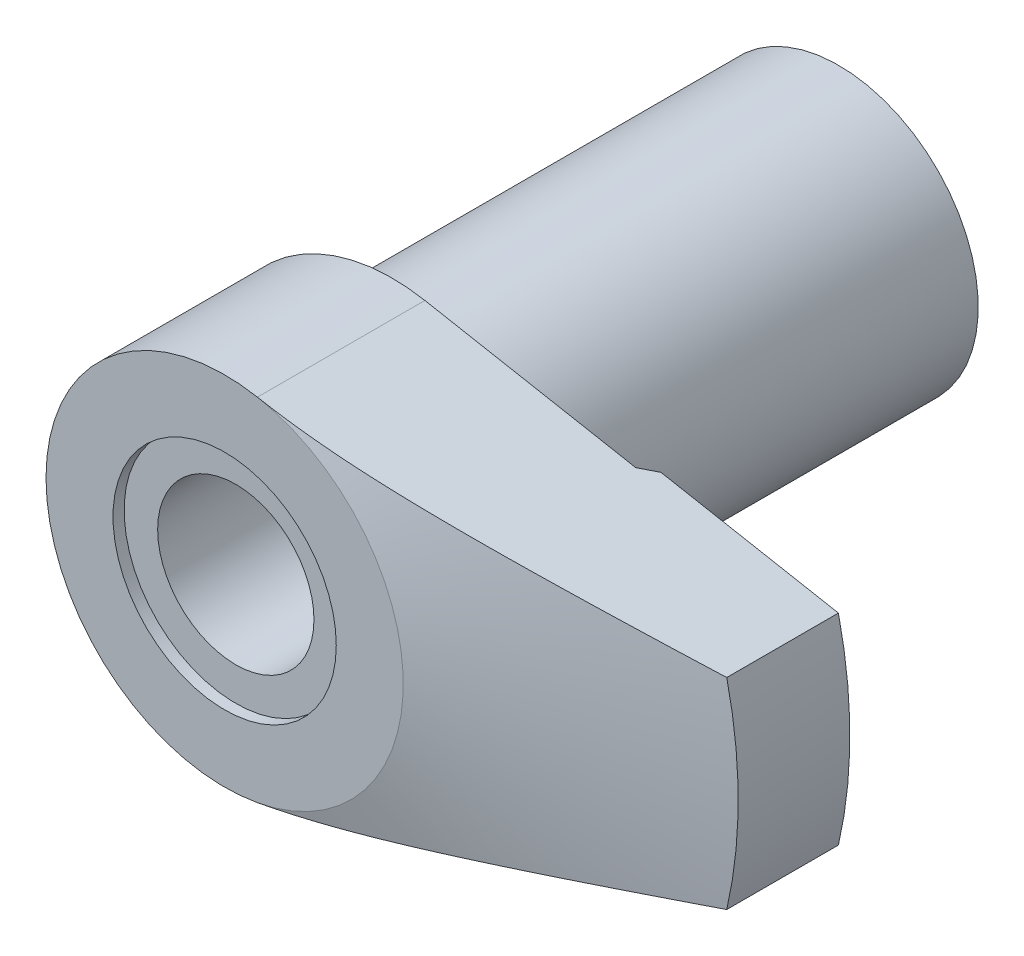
ISO-10303-21;
HEADER;
FILE_DESCRIPTION(('STEP AP214'),'2;1');
FILE_NAME('part.step','',(''),(''),'','','');
FILE_SCHEMA(('AUTOMOTIVE_DESIGN { 1 0 10303 214 1 1 1 1 }'));
ENDSEC;
DATA;
#1=APPLICATION_CONTEXT('core data for automotive mechanical design processes');
#2=APPLICATION_PROTOCOL_DEFINITION('international standard','automotive_design',2000,#1);
#3=PRODUCT_CONTEXT('',#1,'mechanical');
#4=PRODUCT('Part','Part','',(#3));
#5=PRODUCT_RELATED_PRODUCT_CATEGORY('part','',(#4));
#6=PRODUCT_DEFINITION_FORMATION('','',#4);
#7=PRODUCT_DEFINITION_CONTEXT('part definition',#1,'design');
#8=PRODUCT_DEFINITION('design','',#6,#7);
#9=PRODUCT_DEFINITION_SHAPE('','',#8);
#10=(LENGTH_UNIT() NAMED_UNIT(*) SI_UNIT(.MILLI.,.METRE.));
#11=(NAMED_UNIT(*) PLANE_ANGLE_UNIT() SI_UNIT($,.RADIAN.));
#12=(NAMED_UNIT(*) SI_UNIT($,.STERADIAN.) SOLID_ANGLE_UNIT());
#13=UNCERTAINTY_MEASURE_WITH_UNIT(LENGTH_MEASURE(1.E-05),#10,'distance_accuracy_value','');
#14=(GEOMETRIC_REPRESENTATION_CONTEXT(3) GLOBAL_UNCERTAINTY_ASSIGNED_CONTEXT((#13)) GLOBAL_UNIT_ASSIGNED_CONTEXT((#10,
#11,#12)) REPRESENTATION_CONTEXT('',''));
#15=CARTESIAN_POINT('',(0.,0.,0.));
#16=DIRECTION('',(0.,0.,1.));
#17=DIRECTION('',(1.,0.,0.));
#18=AXIS2_PLACEMENT_3D('',#15,#16,#17);
#19=CARTESIAN_POINT('',(38.9743505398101,9.,55.));
#20=DIRECTION('',(-0.183527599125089,-0.983014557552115,0.));
#21=DIRECTION('',(0.983014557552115,-0.183527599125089,0.));
#22=AXIS2_PLACEMENT_3D('',#19,#20,#21);
#23=PLANE('',#22);
#24=DIRECTION('',(0.983014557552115,-0.183527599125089,0.));
#25=VECTOR('',#24,1.);
#26=CARTESIAN_POINT('',(2.93644158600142,15.7282329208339,40.));
#27=LINE('',#26,#25);
#28=CARTESIAN_POINT('',(2.93644158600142,15.7282329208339,40.));
#29=VERTEX_POINT('',#28);
#30=CARTESIAN_POINT('',(21.8195346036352,12.2027828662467,40.));
#31=VERTEX_POINT('',#30);
#32=EDGE_CURVE('E75',#29,#31,#27,.T.);
#33=ORIENTED_EDGE('',*,*,#32,.F.);
#34=DIRECTION('',(0.,0.,-1.));
#35=VECTOR('',#34,1.);
#36=CARTESIAN_POINT('',(2.93644158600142,15.7282329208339,55.));
#37=LINE('',#36,#35);
#38=CARTESIAN_POINT('',(2.93644158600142,15.7282329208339,55.));
#39=VERTEX_POINT('',#38);
#40=EDGE_CURVE('E79',#39,#29,#37,.T.);
#41=ORIENTED_EDGE('',*,*,#40,.F.);
#42=CARTESIAN_POINT('',(2.93624158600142,15.7282702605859,54.9999999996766));
#43=CARTESIAN_POINT('',(3.27198005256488,15.6655883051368,55.0000135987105));
#44=CARTESIAN_POINT('',(3.60771690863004,15.6029066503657,54.9972684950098));
#45=CARTESIAN_POINT('',(4.27909896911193,15.4775604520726,54.9863525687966));
#46=CARTESIAN_POINT('',(4.61474417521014,15.4148959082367,54.9781818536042));
#47=CARTESIAN_POINT('',(5.28578738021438,15.2896129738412,54.9565089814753));
#48=CARTESIAN_POINT('',(5.62118541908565,15.2269945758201,54.9430081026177));
#49=CARTESIAN_POINT('',(6.29174105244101,15.1018026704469,54.910851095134));
#50=CARTESIAN_POINT('',(6.62689864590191,15.0392291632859,54.8921949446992));
#51=CARTESIAN_POINT('',(7.63088618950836,14.8517859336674,54.8288811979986));
#52=CARTESIAN_POINT('',(8.29927611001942,14.7269983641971,54.7768432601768));
#53=CARTESIAN_POINT('',(9.63452756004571,14.4777085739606,54.6552798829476));
#54=CARTESIAN_POINT('',(10.3013889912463,14.3532063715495,54.5857533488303));
#55=CARTESIAN_POINT('',(11.6317544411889,14.1048287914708,54.4318940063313));
#56=CARTESIAN_POINT('',(12.2952626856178,13.9809526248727,54.3475986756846));
#57=CARTESIAN_POINT('',(13.6206011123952,13.7335135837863,54.1664787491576));
#58=CARTESIAN_POINT('',(14.2824313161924,13.6099507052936,54.0696543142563));
#59=CARTESIAN_POINT('',(15.604824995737,13.3630614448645,53.8655820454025));
#60=CARTESIAN_POINT('',(16.2653877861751,13.2397351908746,53.7583296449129));
#61=CARTESIAN_POINT('',(17.5851193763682,12.9933429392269,53.5352726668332));
#62=CARTESIAN_POINT('',(18.244288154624,12.8702769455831,53.4194679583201));
#63=CARTESIAN_POINT('',(19.7431177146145,12.5904473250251,53.1479184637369));
#64=CARTESIAN_POINT('',(20.5823917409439,12.4337559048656,52.9899704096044));
#65=CARTESIAN_POINT('',(22.259269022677,12.1206849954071,52.6651711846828));
#66=CARTESIAN_POINT('',(23.0968722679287,11.9643055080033,52.4983199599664));
#67=CARTESIAN_POINT('',(24.7705715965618,11.6518279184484,52.1576412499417));
#68=CARTESIAN_POINT('',(25.6066678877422,11.4957297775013,51.9838148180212));
#69=CARTESIAN_POINT('',(27.2777257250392,11.1837453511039,51.6306071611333));
#70=CARTESIAN_POINT('',(28.1126872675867,11.0278590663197,51.4512259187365));
#71=CARTESIAN_POINT('',(29.7842993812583,10.7157711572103,51.0874381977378));
#72=CARTESIAN_POINT('',(30.6209469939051,10.5595700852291,50.903017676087));
#73=CARTESIAN_POINT('',(32.2934616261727,10.2473136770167,50.5305455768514));
#74=CARTESIAN_POINT('',(33.1293286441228,10.0912583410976,50.3424939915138));
#75=CARTESIAN_POINT('',(34.8004037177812,9.77927069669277,49.9634277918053));
#76=CARTESIAN_POINT('',(35.6356117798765,9.62333838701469,49.7724132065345));
#77=CARTESIAN_POINT('',(37.3054715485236,9.31157763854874,49.3879134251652));
#78=CARTESIAN_POINT('',(38.1401232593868,9.15574919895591,49.1944282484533));
#79=CARTESIAN_POINT('',(38.9745505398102,8.99996266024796,48.9999533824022));
#80=B_SPLINE_CURVE_WITH_KNOTS('',3,(#42,#43,#44,#45,#46,#47,#48,#49,#50,#51,#52,#53,#54,#55,#56,
#57,#58,#59,#60,#61,#62,#63,#64,#65,#66,#67,#68,#69,#70,#71,#72,#73,#74,#75,#76,#77,#78,#79),
.UNSPECIFIED.,.F.,.F.,(4,2,2,2,2,2,2,2,2,2,2,2,2,2,2,2,2,2,4),(0.,1.02460521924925,
2.04919017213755,3.07352959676,4.09787335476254,6.14337060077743,8.18899591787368,
10.2295034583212,12.2699847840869,14.3113637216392,16.3527739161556,18.9574987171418,
21.5622392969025,24.1665879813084,26.7709448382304,29.383501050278,31.9960628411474,
34.6085989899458,37.2211146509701),.UNSPECIFIED.);
#81=CARTESIAN_POINT('',(38.9743505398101,9.,49.));
#82=VERTEX_POINT('',#81);
#83=EDGE_CURVE('E141',#39,#82,#80,.T.);
#84=ORIENTED_EDGE('',*,*,#83,.T.);
#85=DIRECTION('',(0.,0.,-1.));
#86=VECTOR('',#85,1.);
#87=CARTESIAN_POINT('',(38.9743505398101,9.,55.));
#88=LINE('',#87,#86);
#89=CARTESIAN_POINT('',(38.9743505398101,9.,39.));
#90=VERTEX_POINT('',#89);
#91=EDGE_CURVE('E98',#82,#90,#88,.T.);
#92=ORIENTED_EDGE('',*,*,#91,.T.);
#93=DIRECTION('',(-0.983014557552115,0.183527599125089,0.));
#94=VECTOR('',#93,1.);
#95=CARTESIAN_POINT('',(38.9743505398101,9.,39.));
#96=LINE('',#95,#94);
#97=CARTESIAN_POINT('',(23.0822451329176,11.9670363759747,39.));
#98=VERTEX_POINT('',#97);
#99=EDGE_CURVE('E197',#90,#98,#96,.T.);
#100=ORIENTED_EDGE('',*,*,#99,.T.);
#101=CARTESIAN_POINT('',(40.1786023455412,8.77516768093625,23.8742944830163));
#102=CARTESIAN_POINT('',(39.6467833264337,8.874457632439,24.3726670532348));
#103=CARTESIAN_POINT('',(39.1141841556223,8.97389323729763,24.8701800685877));
#104=CARTESIAN_POINT('',(38.0472005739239,9.17309774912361,25.8632281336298));
#105=CARTESIAN_POINT('',(37.5128161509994,9.27286665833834,26.3587631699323));
#106=CARTESIAN_POINT('',(36.4419624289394,9.47279372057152,27.3476652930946));
#107=CARTESIAN_POINT('',(35.90549282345,9.57295193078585,27.8410320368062));
#108=CARTESIAN_POINT('',(34.8302806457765,9.77369271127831,28.8251946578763));
#109=CARTESIAN_POINT('',(34.2915380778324,9.87427528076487,29.3159905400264));
#110=CARTESIAN_POINT('',(33.2121145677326,10.0758023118,30.2940334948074));
#111=CARTESIAN_POINT('',(32.6714367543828,10.1767461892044,30.7812841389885));
#112=CARTESIAN_POINT('',(31.5871210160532,10.3791865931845,31.7523641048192));
#113=CARTESIAN_POINT('',(31.0434830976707,10.4806831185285,32.2361934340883));
#114=CARTESIAN_POINT('',(29.9528278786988,10.6843070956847,33.199832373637));
#115=CARTESIAN_POINT('',(29.4058107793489,10.7864345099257,33.6796422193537));
#116=CARTESIAN_POINT('',(28.3078228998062,10.9914274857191,34.6345507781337));
#117=CARTESIAN_POINT('',(27.756852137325,11.0942930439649,35.109649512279));
#118=CARTESIAN_POINT('',(26.393346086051,11.3488579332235,36.273644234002));
#119=CARTESIAN_POINT('',(25.5781730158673,11.5010497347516,36.9593585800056));
#120=CARTESIAN_POINT('',(24.3459897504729,11.7310968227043,37.9761861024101));
#121=CARTESIAN_POINT('',(23.9336711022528,11.8080762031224,38.3131873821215));
#122=CARTESIAN_POINT('',(23.1054739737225,11.9626995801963,38.982629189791));
#123=CARTESIAN_POINT('',(22.6895955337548,12.0403435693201,39.3150697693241));
#124=CARTESIAN_POINT('',(21.8526059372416,12.1966084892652,39.9755863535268));
#125=CARTESIAN_POINT('',(21.4314832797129,12.2752315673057,40.3036472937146));
#126=CARTESIAN_POINT('',(20.5845886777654,12.4333457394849,40.9535163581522));
#127=CARTESIAN_POINT('',(20.1588166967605,12.5128368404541,41.2753244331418));
#128=CARTESIAN_POINT('',(19.3020132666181,12.672800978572,41.9114994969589));
#129=CARTESIAN_POINT('',(18.8709825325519,12.7532738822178,42.2258674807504));
#130=CARTESIAN_POINT('',(18.0028295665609,12.9153569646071,42.8457825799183));
#131=CARTESIAN_POINT('',(17.5657074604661,12.9969671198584,43.1513298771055));
#132=CARTESIAN_POINT('',(16.7784061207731,13.1439553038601,43.6877978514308));
#133=CARTESIAN_POINT('',(16.4295594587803,13.209084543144,43.9207406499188));
#134=CARTESIAN_POINT('',(15.7270455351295,13.3402430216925,44.3789711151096));
#135=CARTESIAN_POINT('',(15.3733784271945,13.4062722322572,44.6042590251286));
#136=CARTESIAN_POINT('',(14.6605102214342,13.5393638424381,45.045997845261));
#137=CARTESIAN_POINT('',(14.3013066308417,13.6064267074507,45.2624446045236));
#138=CARTESIAN_POINT('',(13.5769660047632,13.7416602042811,45.6848225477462));
#139=CARTESIAN_POINT('',(13.2118290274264,13.8098308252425,45.8907538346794));
#140=CARTESIAN_POINT('',(12.4762816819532,13.9471566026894,46.2895504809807));
#141=CARTESIAN_POINT('',(12.1058936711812,14.0163075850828,46.4824581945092));
#142=CARTESIAN_POINT('',(11.3581628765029,14.1559079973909,46.8537220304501));
#143=CARTESIAN_POINT('',(10.9808196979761,14.2263575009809,47.0320773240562));
#144=CARTESIAN_POINT('',(9.83822418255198,14.4396786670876,47.5411943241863));
#145=CARTESIAN_POINT('',(9.06148268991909,14.5846953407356,47.8465215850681));
#146=CARTESIAN_POINT('',(7.8047477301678,14.8193261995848,48.2570630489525));
#147=CARTESIAN_POINT('',(7.33437501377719,14.9071442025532,48.3928913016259));
#148=CARTESIAN_POINT('',(6.38452688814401,15.0844796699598,48.6267240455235));
#149=CARTESIAN_POINT('',(5.90505266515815,15.1739969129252,48.7247334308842));
#150=CARTESIAN_POINT('',(4.9415661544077,15.3538786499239,48.8777308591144));
#151=CARTESIAN_POINT('',(4.45758274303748,15.44423775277,48.9329044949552));
#152=CARTESIAN_POINT('',(3.48665147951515,15.625509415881,48.9977948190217));
#153=CARTESIAN_POINT('',(2.99970378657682,15.7164219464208,49.0075139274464));
#154=CARTESIAN_POINT('',(2.0277206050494,15.8978900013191,48.9809301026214));
#155=CARTESIAN_POINT('',(1.54268340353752,15.9884458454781,48.9446907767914));
#156=CARTESIAN_POINT('',(0.577737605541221,16.1686000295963,48.8284293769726));
#157=CARTESIAN_POINT('',(0.0978295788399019,16.2581982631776,48.7484024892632));
#158=CARTESIAN_POINT('',(-0.858711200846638,16.4367832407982,48.5477639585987));
#159=CARTESIAN_POINT('',(-1.33526041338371,16.5257543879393,48.4267460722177));
#160=CARTESIAN_POINT('',(-2.27829987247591,16.7018186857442,48.1497677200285));
#161=CARTESIAN_POINT('',(-2.74479051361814,16.7889119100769,47.9938086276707));
#162=CARTESIAN_POINT('',(-3.61460118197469,16.9513044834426,47.6719285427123));
#163=CARTESIAN_POINT('',(-4.01906461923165,17.026817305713,47.5091653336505));
#164=CARTESIAN_POINT('',(-4.81988363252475,17.1763292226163,47.1640425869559));
#165=CARTESIAN_POINT('',(-5.21623752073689,17.2503280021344,46.981679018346));
#166=CARTESIAN_POINT('',(-6.00183346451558,17.3969977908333,46.6001620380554));
#167=CARTESIAN_POINT('',(-6.39106240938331,17.4696663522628,46.4009808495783));
#168=CARTESIAN_POINT('',(-7.16228886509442,17.6136533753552,45.9887459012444));
#169=CARTESIAN_POINT('',(-7.54428689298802,17.6849719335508,45.7756931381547));
#170=CARTESIAN_POINT('',(-8.29010319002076,17.8242149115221,45.3446185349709));
#171=CARTESIAN_POINT('',(-8.65411955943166,17.8921763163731,45.1269500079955));
#172=CARTESIAN_POINT('',(-9.37660761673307,18.0270639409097,44.6822681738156));
#173=CARTESIAN_POINT('',(-9.73507899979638,18.0939901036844,44.4552543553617));
#174=CARTESIAN_POINT('',(-10.4454112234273,18.2266082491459,43.9943178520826));
#175=CARTESIAN_POINT('',(-10.7972946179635,18.2923044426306,43.7604310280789));
#176=CARTESIAN_POINT('',(-11.4965319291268,18.4228511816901,43.2859037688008));
#177=CARTESIAN_POINT('',(-11.8438867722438,18.4877019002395,43.0452647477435));
#178=CARTESIAN_POINT('',(-12.1892639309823,18.5521833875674,42.8017644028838));
#179=B_SPLINE_CURVE_WITH_KNOTS('',3,(#101,#102,#103,#104,#105,#106,#107,#108,#109,#110,#111,
#112,#113,#114,#115,#116,#117,#118,#119,#120,#121,#122,#123,#124,#125,#126,#127,#128,#129,#130,
#131,#132,#133,#134,#135,#136,#137,#138,#139,#140,#141,#142,#143,#144,#145,#146,#147,#148,#149,
#150,#151,#152,#153,#154,#155,#156,#157,#158,#159,#160,#161,#162,#163,#164,#165,#166,#167,#168,
#169,#170,#171,#172,#173,#174,#175,#176,#177,#178),.UNSPECIFIED.,.F.,.F.,(4,2,2,2,2,2,2,2,2,2,2,
2,2,2,2,2,2,2,2,2,2,2,2,2,2,2,2,2,2,2,2,2,2,2,2,2,2,2,4),(0.,2.2067150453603,4.41344500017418,
6.62051244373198,8.82757577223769,11.0319722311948,13.2363637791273,15.4406252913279,
17.6448769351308,20.8728392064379,22.48697736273,24.1010972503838,25.7197980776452,
27.3385116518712,28.9570075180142,30.5754700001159,31.8488805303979,33.1222505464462,
34.3962116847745,35.670160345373,36.9397436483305,38.2093992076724,40.7455062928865,
42.2364881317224,43.7272769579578,45.2115700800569,46.6957841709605,48.1779463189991,
49.6602714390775,51.1577392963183,52.6551483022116,53.982007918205,55.3091409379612,
56.6385104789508,57.9677846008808,59.2562527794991,60.5447915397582,61.8275068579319,
63.109955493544),.UNSPECIFIED.);
#180=EDGE_CURVE('E82',#98,#31,#179,.T.);
#181=ORIENTED_EDGE('',*,*,#180,.T.);
#182=EDGE_LOOP('',(#33,#41,#84,#92,#100,#181));
#183=FACE_BOUND('',#182,.T.);
#184=ADVANCED_FACE('F14',(#183),#23,.F.);
#185=CARTESIAN_POINT('',(38.9743505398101,-9.,55.));
#186=DIRECTION('',(0.183527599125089,-0.983014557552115,0.));
#187=DIRECTION('',(0.983014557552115,0.183527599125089,0.));
#188=AXIS2_PLACEMENT_3D('',#185,#186,#187);
#189=PLANE('',#188);
#190=DIRECTION('',(0.,0.,-1.));
#191=VECTOR('',#190,1.);
#192=CARTESIAN_POINT('',(2.93644158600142,-15.7282329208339,55.));
#193=LINE('',#192,#191);
#194=CARTESIAN_POINT('',(2.93644158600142,-15.7282329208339,55.));
#195=VERTEX_POINT('',#194);
#196=CARTESIAN_POINT('',(2.93644158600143,-15.7282329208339,40.));
#197=VERTEX_POINT('',#196);
#198=EDGE_CURVE('E99',#195,#197,#193,.T.);
#199=ORIENTED_EDGE('',*,*,#198,.T.);
#200=DIRECTION('',(-0.983014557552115,-0.183527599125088,0.));
#201=VECTOR('',#200,1.);
#202=CARTESIAN_POINT('',(21.8195346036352,-12.2027828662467,40.));
#203=LINE('',#202,#201);
#204=CARTESIAN_POINT('',(21.8195346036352,-12.2027828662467,40.));
#205=VERTEX_POINT('',#204);
#206=EDGE_CURVE('E85',#205,#197,#203,.T.);
#207=ORIENTED_EDGE('',*,*,#206,.F.);
#208=CARTESIAN_POINT('',(40.1786023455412,-8.77516768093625,23.8742944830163));
#209=CARTESIAN_POINT('',(39.6467833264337,-8.874457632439,24.3726670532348));
#210=CARTESIAN_POINT('',(39.1141841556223,-8.97389323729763,24.8701800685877));
#211=CARTESIAN_POINT('',(38.0472005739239,-9.17309774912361,25.8632281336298));
#212=CARTESIAN_POINT('',(37.5128161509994,-9.27286665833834,26.3587631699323));
#213=CARTESIAN_POINT('',(36.4419624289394,-9.47279372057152,27.3476652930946));
#214=CARTESIAN_POINT('',(35.90549282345,-9.57295193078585,27.8410320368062));
#215=CARTESIAN_POINT('',(34.8302806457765,-9.77369271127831,28.8251946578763));
#216=CARTESIAN_POINT('',(34.2915380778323,-9.87427528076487,29.3159905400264));
#217=CARTESIAN_POINT('',(33.2121145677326,-10.0758023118,30.2940334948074));
#218=CARTESIAN_POINT('',(32.6714367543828,-10.1767461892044,30.7812841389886));
#219=CARTESIAN_POINT('',(31.5871210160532,-10.3791865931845,31.7523641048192));
#220=CARTESIAN_POINT('',(31.0434830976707,-10.4806831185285,32.2361934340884));
#221=CARTESIAN_POINT('',(29.9528278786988,-10.6843070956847,33.199832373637));
#222=CARTESIAN_POINT('',(29.4058107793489,-10.7864345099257,33.6796422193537));
#223=CARTESIAN_POINT('',(28.3078228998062,-10.9914274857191,34.6345507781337));
#224=CARTESIAN_POINT('',(27.756852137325,-11.0942930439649,35.109649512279));
#225=CARTESIAN_POINT('',(26.393346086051,-11.3488579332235,36.273644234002));
#226=CARTESIAN_POINT('',(25.5781730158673,-11.5010497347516,36.9593585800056));
#227=CARTESIAN_POINT('',(24.3459897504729,-11.7310968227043,37.9761861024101));
#228=CARTESIAN_POINT('',(23.9336711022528,-11.8080762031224,38.3131873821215));
#229=CARTESIAN_POINT('',(23.1054739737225,-11.9626995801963,38.982629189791));
#230=CARTESIAN_POINT('',(22.6895955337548,-12.0403435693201,39.3150697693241));
#231=CARTESIAN_POINT('',(21.8526059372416,-12.1966084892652,39.9755863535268));
#232=CARTESIAN_POINT('',(21.4314832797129,-12.2752315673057,40.3036472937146));
#233=CARTESIAN_POINT('',(20.5845886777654,-12.4333457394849,40.9535163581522));
#234=CARTESIAN_POINT('',(20.1588166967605,-12.5128368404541,41.2753244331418));
#235=CARTESIAN_POINT('',(19.3020132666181,-12.672800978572,41.9114994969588));
#236=CARTESIAN_POINT('',(18.870982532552,-12.7532738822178,42.2258674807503));
#237=CARTESIAN_POINT('',(18.0028295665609,-12.9153569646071,42.8457825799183));
#238=CARTESIAN_POINT('',(17.5657074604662,-12.9969671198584,43.1513298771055));
#239=CARTESIAN_POINT('',(16.7784061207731,-13.1439553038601,43.6877978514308));
#240=CARTESIAN_POINT('',(16.4295594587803,-13.209084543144,43.9207406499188));
#241=CARTESIAN_POINT('',(15.7270455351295,-13.3402430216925,44.3789711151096));
#242=CARTESIAN_POINT('',(15.3733784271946,-13.4062722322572,44.6042590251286));
#243=CARTESIAN_POINT('',(14.6605102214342,-13.5393638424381,45.045997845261));
#244=CARTESIAN_POINT('',(14.3013066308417,-13.6064267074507,45.2624446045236));
#245=CARTESIAN_POINT('',(13.5769660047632,-13.7416602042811,45.6848225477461));
#246=CARTESIAN_POINT('',(13.2118290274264,-13.8098308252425,45.8907538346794));
#247=CARTESIAN_POINT('',(12.4762816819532,-13.9471566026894,46.2895504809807));
#248=CARTESIAN_POINT('',(12.1058936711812,-14.0163075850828,46.4824581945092));
#249=CARTESIAN_POINT('',(11.3581628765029,-14.1559079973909,46.8537220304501));
#250=CARTESIAN_POINT('',(10.9808196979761,-14.2263575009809,47.0320773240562));
#251=CARTESIAN_POINT('',(9.83822418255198,-14.4396786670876,47.5411943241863));
#252=CARTESIAN_POINT('',(9.06148268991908,-14.5846953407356,47.8465215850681));
#253=CARTESIAN_POINT('',(7.80474773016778,-14.8193261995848,48.2570630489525));
#254=CARTESIAN_POINT('',(7.33437501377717,-14.9071442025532,48.3928913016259));
#255=CARTESIAN_POINT('',(6.38452688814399,-15.0844796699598,48.6267240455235));
#256=CARTESIAN_POINT('',(5.90505266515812,-15.1739969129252,48.7247334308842));
#257=CARTESIAN_POINT('',(4.94156615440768,-15.3538786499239,48.8777308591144));
#258=CARTESIAN_POINT('',(4.45758274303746,-15.44423775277,48.9329044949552));
#259=CARTESIAN_POINT('',(3.48665147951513,-15.625509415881,48.9977948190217));
#260=CARTESIAN_POINT('',(2.9997037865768,-15.7164219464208,49.0075139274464));
#261=CARTESIAN_POINT('',(2.02772060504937,-15.8978900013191,48.9809301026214));
#262=CARTESIAN_POINT('',(1.54268340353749,-15.9884458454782,48.9446907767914));
#263=CARTESIAN_POINT('',(0.57773760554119,-16.1686000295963,48.8284293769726));
#264=CARTESIAN_POINT('',(0.0978295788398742,-16.2581982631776,48.7484024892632));
#265=CARTESIAN_POINT('',(-0.858711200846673,-16.4367832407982,48.5477639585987));
#266=CARTESIAN_POINT('',(-1.33526041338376,-16.5257543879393,48.4267460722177));
#267=CARTESIAN_POINT('',(-2.27829987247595,-16.7018186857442,48.1497677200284));
#268=CARTESIAN_POINT('',(-2.74479051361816,-16.7889119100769,47.9938086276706));
#269=CARTESIAN_POINT('',(-3.61460118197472,-16.9513044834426,47.6719285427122));
#270=CARTESIAN_POINT('',(-4.0190646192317,-17.026817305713,47.5091653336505));
#271=CARTESIAN_POINT('',(-4.81988363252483,-17.1763292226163,47.1640425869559));
#272=CARTESIAN_POINT('',(-5.21623752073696,-17.2503280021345,46.981679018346));
#273=CARTESIAN_POINT('',(-6.00183346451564,-17.3969977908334,46.6001620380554));
#274=CARTESIAN_POINT('',(-6.39106240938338,-17.4696663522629,46.4009808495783));
#275=CARTESIAN_POINT('',(-7.16228886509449,-17.6136533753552,45.9887459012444));
#276=CARTESIAN_POINT('',(-7.54428689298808,-17.6849719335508,45.7756931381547));
#277=CARTESIAN_POINT('',(-8.29010319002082,-17.8242149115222,45.3446185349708));
#278=CARTESIAN_POINT('',(-8.65411955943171,-17.8921763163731,45.1269500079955));
#279=CARTESIAN_POINT('',(-9.37660761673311,-18.0270639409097,44.6822681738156));
#280=CARTESIAN_POINT('',(-9.73507899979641,-18.0939901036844,44.4552543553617));
#281=CARTESIAN_POINT('',(-10.4454112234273,-18.2266082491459,43.9943178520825));
#282=CARTESIAN_POINT('',(-10.7972946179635,-18.2923044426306,43.7604310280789));
#283=CARTESIAN_POINT('',(-11.4965319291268,-18.4228511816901,43.2859037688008));
#284=CARTESIAN_POINT('',(-11.8438867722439,-18.4877019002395,43.0452647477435));
#285=CARTESIAN_POINT('',(-12.1892639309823,-18.5521833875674,42.8017644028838));
#286=B_SPLINE_CURVE_WITH_KNOTS('',3,(#208,#209,#210,#211,#212,#213,#214,#215,#216,#217,#218,
#219,#220,#221,#222,#223,#224,#225,#226,#227,#228,#229,#230,#231,#232,#233,#234,#235,#236,#237,
#238,#239,#240,#241,#242,#243,#244,#245,#246,#247,#248,#249,#250,#251,#252,#253,#254,#255,#256,
#257,#258,#259,#260,#261,#262,#263,#264,#265,#266,#267,#268,#269,#270,#271,#272,#273,#274,#275,
#276,#277,#278,#279,#280,#281,#282,#283,#284,#285),.UNSPECIFIED.,.F.,.F.,(4,2,2,2,2,2,2,2,2,2,2,
2,2,2,2,2,2,2,2,2,2,2,2,2,2,2,2,2,2,2,2,2,2,2,2,2,2,2,4),(0.,2.2067150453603,4.41344500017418,
6.62051244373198,8.82757577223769,11.0319722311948,13.2363637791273,15.4406252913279,
17.6448769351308,20.8728392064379,22.48697736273,24.1010972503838,25.7197980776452,
27.3385116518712,28.9570075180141,30.5754700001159,31.8488805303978,33.1222505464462,
34.3962116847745,35.6701603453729,36.9397436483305,38.2093992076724,40.7455062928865,
42.2364881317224,43.7272769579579,45.211570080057,46.6957841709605,48.1779463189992,
49.6602714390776,51.1577392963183,52.6551483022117,53.9820079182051,55.3091409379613,
56.6385104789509,57.9677846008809,59.2562527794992,60.5447915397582,61.827506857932,
63.109955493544),.UNSPECIFIED.);
#287=CARTESIAN_POINT('',(23.0822451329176,-11.9670363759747,39.));
#288=VERTEX_POINT('',#287);
#289=EDGE_CURVE('E9',#288,#205,#286,.T.);
#290=ORIENTED_EDGE('',*,*,#289,.F.);
#291=DIRECTION('',(-0.983014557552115,-0.183527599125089,0.));
#292=VECTOR('',#291,1.);
#293=CARTESIAN_POINT('',(38.9743505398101,-9.,39.));
#294=LINE('',#293,#292);
#295=CARTESIAN_POINT('',(38.9743505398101,-9.,39.));
#296=VERTEX_POINT('',#295);
#297=EDGE_CURVE('E28',#296,#288,#294,.T.);
#298=ORIENTED_EDGE('',*,*,#297,.F.);
#299=DIRECTION('',(0.,0.,-1.));
#300=VECTOR('',#299,1.);
#301=CARTESIAN_POINT('',(38.9743505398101,-9.,55.));
#302=LINE('',#301,#300);
#303=CARTESIAN_POINT('',(38.9743505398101,-9.,49.));
#304=VERTEX_POINT('',#303);
#305=EDGE_CURVE('E42',#304,#296,#302,.T.);
#306=ORIENTED_EDGE('',*,*,#305,.F.);
#307=CARTESIAN_POINT('',(2.93624158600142,-15.7282702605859,54.9999999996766));
#308=CARTESIAN_POINT('',(3.27198005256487,-15.6655883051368,55.0000135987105));
#309=CARTESIAN_POINT('',(3.60771690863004,-15.6029066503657,54.9972684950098));
#310=CARTESIAN_POINT('',(4.27909896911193,-15.4775604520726,54.9863525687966));
#311=CARTESIAN_POINT('',(4.61474417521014,-15.4148959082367,54.9781818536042));
#312=CARTESIAN_POINT('',(5.28578738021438,-15.2896129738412,54.9565089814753));
#313=CARTESIAN_POINT('',(5.62118541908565,-15.2269945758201,54.9430081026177));
#314=CARTESIAN_POINT('',(6.29174105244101,-15.1018026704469,54.910851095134));
#315=CARTESIAN_POINT('',(6.62689864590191,-15.0392291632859,54.8921949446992));
#316=CARTESIAN_POINT('',(7.63088618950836,-14.8517859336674,54.8288811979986));
#317=CARTESIAN_POINT('',(8.29927611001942,-14.7269983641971,54.7768432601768));
#318=CARTESIAN_POINT('',(9.63452756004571,-14.4777085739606,54.6552798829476));
#319=CARTESIAN_POINT('',(10.3013889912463,-14.3532063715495,54.5857533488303));
#320=CARTESIAN_POINT('',(11.6317544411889,-14.1048287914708,54.4318940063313));
#321=CARTESIAN_POINT('',(12.2952626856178,-13.9809526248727,54.3475986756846));
#322=CARTESIAN_POINT('',(13.6206011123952,-13.7335135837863,54.1664787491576));
#323=CARTESIAN_POINT('',(14.2824313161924,-13.6099507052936,54.0696543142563));
#324=CARTESIAN_POINT('',(15.604824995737,-13.3630614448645,53.8655820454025));
#325=CARTESIAN_POINT('',(16.2653877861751,-13.2397351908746,53.7583296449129));
#326=CARTESIAN_POINT('',(17.5851193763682,-12.9933429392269,53.5352726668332));
#327=CARTESIAN_POINT('',(18.244288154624,-12.8702769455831,53.4194679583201));
#328=CARTESIAN_POINT('',(19.7431177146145,-12.5904473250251,53.1479184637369));
#329=CARTESIAN_POINT('',(20.5823917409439,-12.4337559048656,52.9899704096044));
#330=CARTESIAN_POINT('',(22.259269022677,-12.1206849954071,52.6651711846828));
#331=CARTESIAN_POINT('',(23.0968722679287,-11.9643055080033,52.4983199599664));
#332=CARTESIAN_POINT('',(24.7705715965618,-11.6518279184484,52.1576412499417));
#333=CARTESIAN_POINT('',(25.6066678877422,-11.4957297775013,51.9838148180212));
#334=CARTESIAN_POINT('',(27.2777257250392,-11.1837453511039,51.6306071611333));
#335=CARTESIAN_POINT('',(28.1126872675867,-11.0278590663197,51.4512259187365));
#336=CARTESIAN_POINT('',(29.7842993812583,-10.7157711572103,51.0874381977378));
#337=CARTESIAN_POINT('',(30.6209469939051,-10.5595700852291,50.903017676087));
#338=CARTESIAN_POINT('',(32.2934616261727,-10.2473136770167,50.5305455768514));
#339=CARTESIAN_POINT('',(33.1293286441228,-10.0912583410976,50.3424939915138));
#340=CARTESIAN_POINT('',(34.8004037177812,-9.77927069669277,49.9634277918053));
#341=CARTESIAN_POINT('',(35.6356117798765,-9.62333838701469,49.7724132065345));
#342=CARTESIAN_POINT('',(37.3054715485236,-9.31157763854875,49.3879134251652));
#343=CARTESIAN_POINT('',(38.1401232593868,-9.15574919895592,49.1944282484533));
#344=CARTESIAN_POINT('',(38.9745505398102,-8.99996266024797,48.9999533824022));
#345=B_SPLINE_CURVE_WITH_KNOTS('',3,(#307,#308,#309,#310,#311,#312,#313,#314,#315,#316,#317,
#318,#319,#320,#321,#322,#323,#324,#325,#326,#327,#328,#329,#330,#331,#332,#333,#334,#335,#336,
#337,#338,#339,#340,#341,#342,#343,#344),.UNSPECIFIED.,.F.,.F.,(4,2,2,2,2,2,2,2,2,2,2,2,2,2,2,2,
2,2,4),(0.,1.02460521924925,2.04919017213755,3.07352959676,4.09787335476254,6.14337060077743,
8.18899591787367,10.2295034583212,12.2699847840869,14.3113637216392,16.3527739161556,
18.9574987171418,21.5622392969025,24.1665879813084,26.7709448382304,29.383501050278,
31.9960628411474,34.6085989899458,37.22111465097),.UNSPECIFIED.);
#346=EDGE_CURVE('E134',#195,#304,#345,.T.);
#347=ORIENTED_EDGE('',*,*,#346,.F.);
#348=EDGE_LOOP('',(#199,#207,#290,#298,#306,#347));
#349=FACE_BOUND('',#348,.T.);
#350=ADVANCED_FACE('F147',(#349),#189,.T.);
#351=CARTESIAN_POINT('',(0.,0.,55.));
#352=DIRECTION('',(0.,0.,-1.));
#353=DIRECTION('',(-1.,0.,0.));
#354=AXIS2_PLACEMENT_3D('',#351,#352,#353);
#355=CYLINDRICAL_SURFACE('',#354,16.);
#356=CARTESIAN_POINT('',(0.,0.,40.));
#357=DIRECTION('',(0.,0.,1.));
#358=DIRECTION('',(1.,0.,0.));
#359=AXIS2_PLACEMENT_3D('',#356,#357,#358);
#360=CIRCLE('',#359,16.);
#361=EDGE_CURVE('E88',#29,#197,#360,.T.);
#362=ORIENTED_EDGE('',*,*,#361,.T.);
#363=ORIENTED_EDGE('',*,*,#198,.F.);
#364=CARTESIAN_POINT('',(0.,0.,55.));
#365=DIRECTION('',(0.,0.,1.));
#366=DIRECTION('',(1.,0.,0.));
#367=AXIS2_PLACEMENT_3D('',#364,#365,#366);
#368=CIRCLE('',#367,16.);
#369=EDGE_CURVE('E97',#39,#195,#368,.T.);
#370=ORIENTED_EDGE('',*,*,#369,.F.);
#371=ORIENTED_EDGE('',*,*,#40,.T.);
#372=EDGE_LOOP('',(#362,#363,#370,#371));
#373=FACE_BOUND('',#372,.T.);
#374=ADVANCED_FACE('F96',(#373),#355,.T.);
#375=CARTESIAN_POINT('',(50.,20.,39.));
#376=DIRECTION('',(0.,0.,1.));
#377=DIRECTION('',(1.,0.,0.));
#378=AXIS2_PLACEMENT_3D('',#375,#376,#377);
#379=PLANE('',#378);
#380=ORIENTED_EDGE('',*,*,#297,.T.);
#381=CARTESIAN_POINT('',(0.,0.,39.));
#382=DIRECTION('',(0.,0.,1.));
#383=DIRECTION('',(1.,0.,0.));
#384=AXIS2_PLACEMENT_3D('',#381,#382,#383);
#385=CIRCLE('',#384,26.);
#386=EDGE_CURVE('E34',#288,#98,#385,.T.);
#387=ORIENTED_EDGE('',*,*,#386,.T.);
#388=ORIENTED_EDGE('',*,*,#99,.F.);
#389=CARTESIAN_POINT('',(0.,0.,39.));
#390=DIRECTION('',(0.,0.,1.));
#391=DIRECTION('',(1.,0.,0.));
#392=AXIS2_PLACEMENT_3D('',#389,#390,#391);
#393=CIRCLE('',#392,40.);
#394=EDGE_CURVE('E195',#296,#90,#393,.T.);
#395=ORIENTED_EDGE('',*,*,#394,.F.);
#396=EDGE_LOOP('',(#380,#387,#388,#395));
#397=FACE_BOUND('',#396,.T.);
#398=ADVANCED_FACE('F164',(#397),#379,.F.);
#399=CARTESIAN_POINT('',(0.,0.,0.));
#400=DIRECTION('',(0.,0.,-1.));
#401=DIRECTION('',(-1.,0.,0.));
#402=AXIS2_PLACEMENT_3D('',#399,#400,#401);
#403=CYLINDRICAL_SURFACE('',#402,7.);
#404=CARTESIAN_POINT('',(0.,0.,34.));
#405=DIRECTION('',(0.,0.,-1.));
#406=DIRECTION('',(-1.,0.,0.));
#407=AXIS2_PLACEMENT_3D('',#404,#405,#406);
#408=CIRCLE('',#407,7.);
#409=CARTESIAN_POINT('',(-7.,0.,34.));
#410=VERTEX_POINT('',#409);
#411=EDGE_CURVE('E108',#410,#410,#408,.T.);
#412=ORIENTED_EDGE('',*,*,#411,.T.);
#413=EDGE_LOOP('',(#412));
#414=FACE_BOUND('',#413,.T.);
#415=CARTESIAN_POINT('',(0.,0.,54.));
#416=DIRECTION('',(0.,0.,1.));
#417=DIRECTION('',(1.,0.,0.));
#418=AXIS2_PLACEMENT_3D('',#415,#416,#417);
#419=CIRCLE('',#418,7.);
#420=CARTESIAN_POINT('',(7.,0.,54.));
#421=VERTEX_POINT('',#420);
#422=EDGE_CURVE('E106',#421,#421,#419,.T.);
#423=ORIENTED_EDGE('',*,*,#422,.T.);
#424=EDGE_LOOP('',(#423));
#425=FACE_BOUND('',#424,.T.);
#426=ADVANCED_FACE('F167',(#414,#425),#403,.F.);
#427=CARTESIAN_POINT('',(0.,0.,0.));
#428=DIRECTION('',(0.,0.,1.));
#429=DIRECTION('',(1.,0.,0.));
#430=AXIS2_PLACEMENT_3D('',#427,#428,#429);
#431=PLANE('',#430);
#432=CARTESIAN_POINT('',(0.,0.,0.));
#433=DIRECTION('',(0.,0.,-1.));
#434=DIRECTION('',(-1.,0.,0.));
#435=AXIS2_PLACEMENT_3D('',#432,#433,#434);
#436=CIRCLE('',#435,12.5);
#437=CARTESIAN_POINT('',(-12.5,0.,0.));
#438=VERTEX_POINT('',#437);
#439=EDGE_CURVE('E198',#438,#438,#436,.T.);
#440=ORIENTED_EDGE('',*,*,#439,.T.);
#441=EDGE_LOOP('',(#440));
#442=FACE_BOUND('',#441,.T.);
#443=CARTESIAN_POINT('',(0.,0.,0.));
#444=DIRECTION('',(0.,0.,-1.));
#445=DIRECTION('',(-1.,0.,0.));
#446=AXIS2_PLACEMENT_3D('',#443,#444,#445);
#447=CIRCLE('',#446,9.5);
#448=CARTESIAN_POINT('',(-9.5,0.,0.));
#449=VERTEX_POINT('',#448);
#450=EDGE_CURVE('E126',#449,#449,#447,.T.);
#451=ORIENTED_EDGE('',*,*,#450,.F.);
#452=EDGE_LOOP('',(#451));
#453=FACE_BOUND('',#452,.T.);
#454=ADVANCED_FACE('F169',(#442,#453),#431,.F.);
#455=CARTESIAN_POINT('',(0.,0.,55.));
#456=DIRECTION('',(0.,0.,1.));
#457=DIRECTION('',(1.,0.,0.));
#458=AXIS2_PLACEMENT_3D('',#455,#456,#457);
#459=PLANE('',#458);
#460=CARTESIAN_POINT('',(0.,0.,55.));
#461=DIRECTION('',(0.,0.,1.));
#462=DIRECTION('',(1.,0.,0.));
#463=AXIS2_PLACEMENT_3D('',#460,#461,#462);
#464=CIRCLE('',#463,10.);
#465=CARTESIAN_POINT('',(10.,0.,55.));
#466=VERTEX_POINT('',#465);
#467=EDGE_CURVE('E116',#466,#466,#464,.T.);
#468=ORIENTED_EDGE('',*,*,#467,.F.);
#469=EDGE_LOOP('',(#468));
#470=FACE_BOUND('',#469,.T.);
#471=CARTESIAN_POINT('',(0.,0.,55.));
#472=DIRECTION('',(0.,0.,1.));
#473=DIRECTION('',(1.,0.,0.));
#474=AXIS2_PLACEMENT_3D('',#471,#472,#473);
#475=CIRCLE('',#474,16.);
#476=EDGE_CURVE('E129',#195,#39,#475,.T.);
#477=ORIENTED_EDGE('',*,*,#476,.T.);
#478=ORIENTED_EDGE('',*,*,#369,.T.);
#479=EDGE_LOOP('',(#477,#478));
#480=FACE_BOUND('',#479,.T.);
#481=ADVANCED_FACE('F172',(#470,#480),#459,.T.);
#482=CARTESIAN_POINT('',(0.,0.,55.));
#483=DIRECTION('',(0.,0.,-1.));
#484=DIRECTION('',(-1.,0.,0.));
#485=AXIS2_PLACEMENT_3D('',#482,#483,#484);
#486=CYLINDRICAL_SURFACE('',#485,40.);
#487=ORIENTED_EDGE('',*,*,#91,.F.);
#488=CARTESIAN_POINT('',(0.,0.,49.));
#489=DIRECTION('',(0.,0.,1.));
#490=DIRECTION('',(1.,0.,0.));
#491=AXIS2_PLACEMENT_3D('',#488,#489,#490);
#492=CIRCLE('',#491,40.);
#493=EDGE_CURVE('E132',#304,#82,#492,.T.);
#494=ORIENTED_EDGE('',*,*,#493,.F.);
#495=ORIENTED_EDGE('',*,*,#305,.T.);
#496=ORIENTED_EDGE('',*,*,#394,.T.);
#497=EDGE_LOOP('',(#487,#494,#495,#496));
#498=FACE_BOUND('',#497,.T.);
#499=ADVANCED_FACE('F162',(#498),#486,.T.);
#500=CARTESIAN_POINT('',(0.,0.,39.));
#501=DIRECTION('',(0.,0.,-1.));
#502=DIRECTION('',(-1.,0.,0.));
#503=AXIS2_PLACEMENT_3D('',#500,#501,#502);
#504=CYLINDRICAL_SURFACE('',#503,12.5);
#505=ORIENTED_EDGE('',*,*,#439,.F.);
#506=EDGE_LOOP('',(#505));
#507=FACE_BOUND('',#506,.T.);
#508=CARTESIAN_POINT('',(0.,0.,40.));
#509=DIRECTION('',(0.,0.,1.));
#510=DIRECTION('',(1.,0.,0.));
#511=AXIS2_PLACEMENT_3D('',#508,#509,#510);
#512=CIRCLE('',#511,12.5);
#513=CARTESIAN_POINT('',(12.5,0.,40.));
#514=VERTEX_POINT('',#513);
#515=EDGE_CURVE('E94',#514,#514,#512,.T.);
#516=ORIENTED_EDGE('',*,*,#515,.F.);
#517=EDGE_LOOP('',(#516));
#518=FACE_BOUND('',#517,.T.);
#519=ADVANCED_FACE('F156',(#507,#518),#504,.T.);
#520=CARTESIAN_POINT('',(0.,0.,49.));
#521=DIRECTION('',(0.,0.,-1.));
#522=DIRECTION('',(-1.,0.,0.));
#523=AXIS2_PLACEMENT_3D('',#520,#521,#522);
#524=CONICAL_SURFACE('',#523,40.,1.32581766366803);
#525=ORIENTED_EDGE('',*,*,#476,.F.);
#526=ORIENTED_EDGE('',*,*,#346,.T.);
#527=ORIENTED_EDGE('',*,*,#493,.T.);
#528=ORIENTED_EDGE('',*,*,#83,.F.);
#529=EDGE_LOOP('',(#525,#526,#527,#528));
#530=FACE_BOUND('',#529,.T.);
#531=ADVANCED_FACE('F150',(#530),#524,.T.);
#532=CARTESIAN_POINT('',(0.,0.,0.));
#533=DIRECTION('',(0.,0.,-1.));
#534=DIRECTION('',(-1.,0.,0.));
#535=AXIS2_PLACEMENT_3D('',#532,#533,#534);
#536=CYLINDRICAL_SURFACE('',#535,9.5);
#537=ORIENTED_EDGE('',*,*,#450,.T.);
#538=EDGE_LOOP('',(#537));
#539=FACE_BOUND('',#538,.T.);
#540=CARTESIAN_POINT('',(0.,0.,34.));
#541=DIRECTION('',(0.,0.,-1.));
#542=DIRECTION('',(-1.,0.,0.));
#543=AXIS2_PLACEMENT_3D('',#540,#541,#542);
#544=CIRCLE('',#543,9.5);
#545=CARTESIAN_POINT('',(-9.5,0.,34.));
#546=VERTEX_POINT('',#545);
#547=EDGE_CURVE('E113',#546,#546,#544,.T.);
#548=ORIENTED_EDGE('',*,*,#547,.F.);
#549=EDGE_LOOP('',(#548));
#550=FACE_BOUND('',#549,.T.);
#551=ADVANCED_FACE('F155',(#539,#550),#536,.F.);
#552=CARTESIAN_POINT('',(7.,0.,34.));
#553=DIRECTION('',(0.,0.,-1.));
#554=DIRECTION('',(-1.,0.,0.));
#555=AXIS2_PLACEMENT_3D('',#552,#553,#554);
#556=PLANE('',#555);
#557=ORIENTED_EDGE('',*,*,#547,.T.);
#558=EDGE_LOOP('',(#557));
#559=FACE_BOUND('',#558,.T.);
#560=ORIENTED_EDGE('',*,*,#411,.F.);
#561=EDGE_LOOP('',(#560));
#562=FACE_BOUND('',#561,.T.);
#563=ADVANCED_FACE('F226',(#559,#562),#556,.T.);
#564=CARTESIAN_POINT('',(0.,0.,54.));
#565=DIRECTION('',(0.,0.,1.));
#566=DIRECTION('',(1.,0.,0.));
#567=AXIS2_PLACEMENT_3D('',#564,#565,#566);
#568=CYLINDRICAL_SURFACE('',#567,10.);
#569=CARTESIAN_POINT('',(0.,0.,54.));
#570=DIRECTION('',(0.,0.,1.));
#571=DIRECTION('',(1.,0.,0.));
#572=AXIS2_PLACEMENT_3D('',#569,#570,#571);
#573=CIRCLE('',#572,10.);
#574=CARTESIAN_POINT('',(10.,0.,54.));
#575=VERTEX_POINT('',#574);
#576=EDGE_CURVE('E109',#575,#575,#573,.T.);
#577=ORIENTED_EDGE('',*,*,#576,.F.);
#578=EDGE_LOOP('',(#577));
#579=FACE_BOUND('',#578,.T.);
#580=ORIENTED_EDGE('',*,*,#467,.T.);
#581=EDGE_LOOP('',(#580));
#582=FACE_BOUND('',#581,.T.);
#583=ADVANCED_FACE('F219',(#579,#582),#568,.F.);
#584=CARTESIAN_POINT('',(0.,0.,54.));
#585=DIRECTION('',(0.,0.,1.));
#586=DIRECTION('',(1.,0.,0.));
#587=AXIS2_PLACEMENT_3D('',#584,#585,#586);
#588=PLANE('',#587);
#589=ORIENTED_EDGE('',*,*,#422,.F.);
#590=EDGE_LOOP('',(#589));
#591=FACE_BOUND('',#590,.T.);
#592=ORIENTED_EDGE('',*,*,#576,.T.);
#593=EDGE_LOOP('',(#592));
#594=FACE_BOUND('',#593,.T.);
#595=ADVANCED_FACE('F212',(#591,#594),#588,.T.);
#596=CARTESIAN_POINT('',(-12.5,0.,40.));
#597=DIRECTION('',(0.,0.,-1.));
#598=DIRECTION('',(-1.,0.,0.));
#599=AXIS2_PLACEMENT_3D('',#596,#597,#598);
#600=PLANE('',#599);
#601=ORIENTED_EDGE('',*,*,#515,.T.);
#602=EDGE_LOOP('',(#601));
#603=FACE_BOUND('',#602,.T.);
#604=ORIENTED_EDGE('',*,*,#361,.F.);
#605=ORIENTED_EDGE('',*,*,#32,.T.);
#606=CARTESIAN_POINT('',(0.,0.,40.));
#607=DIRECTION('',(0.,0.,1.));
#608=DIRECTION('',(1.,0.,0.));
#609=AXIS2_PLACEMENT_3D('',#606,#607,#608);
#610=CIRCLE('',#609,25.);
#611=EDGE_CURVE('E339',#205,#31,#610,.T.);
#612=ORIENTED_EDGE('',*,*,#611,.F.);
#613=ORIENTED_EDGE('',*,*,#206,.T.);
#614=EDGE_LOOP('',(#604,#605,#612,#613));
#615=FACE_BOUND('',#614,.T.);
#616=ADVANCED_FACE('F89',(#603,#615),#600,.T.);
#617=CARTESIAN_POINT('',(0.,0.,40.));
#618=DIRECTION('',(0.,0.,-1.));
#619=DIRECTION('',(-1.,0.,0.));
#620=AXIS2_PLACEMENT_3D('',#617,#618,#619);
#621=CONICAL_SURFACE('',#620,25.,0.785398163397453);
#622=ORIENTED_EDGE('',*,*,#386,.F.);
#623=ORIENTED_EDGE('',*,*,#289,.T.);
#624=ORIENTED_EDGE('',*,*,#611,.T.);
#625=ORIENTED_EDGE('',*,*,#180,.F.);
#626=EDGE_LOOP('',(#622,#623,#624,#625));
#627=FACE_BOUND('',#626,.T.);
#628=ADVANCED_FACE('F211',(#627),#621,.F.);
#629=CLOSED_SHELL('',(#184,#350,#374,#398,#426,#454,#481,#499,#519,#531,#551,#563,#583,#595,
#616,#628));
#630=MANIFOLD_SOLID_BREP('B1',#629);
#631=ADVANCED_BREP_SHAPE_REPRESENTATION('',(#18,#630),#14);
#632=SHAPE_DEFINITION_REPRESENTATION(#9,#631);
ENDSEC;
END-ISO-10303-21;
